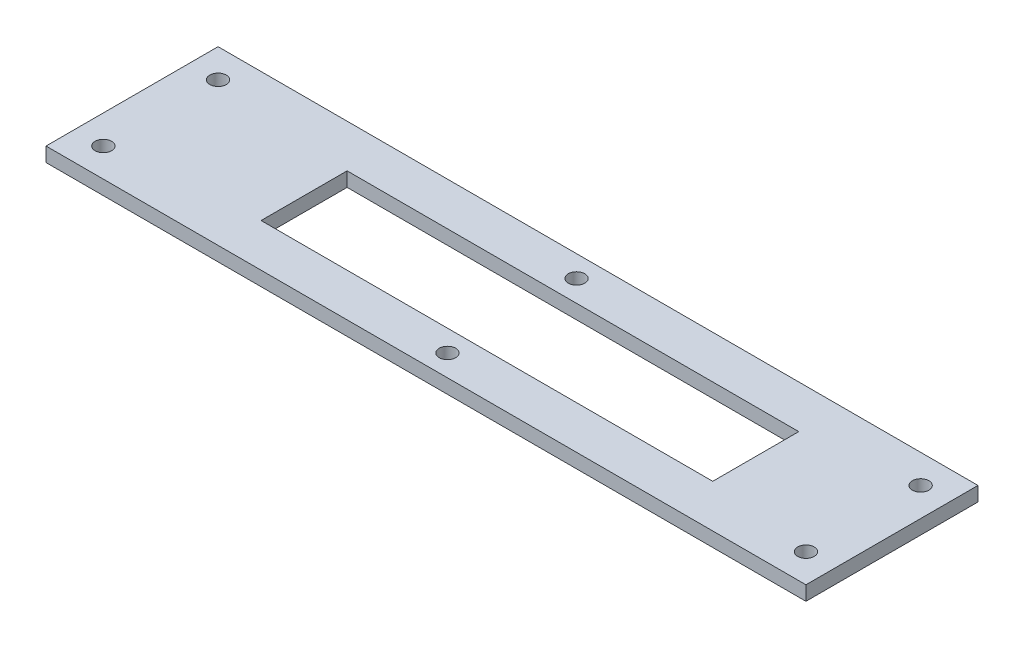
from build123d import *

# Parameters (mm, degrees)
SKETCH1_W           = 106
SKETCH1_H           = 24
SKETCH1_R           = 1.15
SKETCH1_W_2         = 63
SKETCH1_H_2         = 12
BOSS_EXTRUDE1_DEPTH = 2


with BuildPart() as part:
    # Sketch1 → Boss-Extrude1 (new body)
    with BuildSketch(Plane(origin=(0, 0, 0), x_dir=(1, 0, 0), z_dir=(0, 1, 0))):
        with Locations((-0.5, 0)):
            Rectangle(SKETCH1_W, SKETCH1_H)
        with Locations(Location((-49.5, 8, 0), (0, 0, 270))):
            Circle(SKETCH1_R, mode=Mode.SUBTRACT)
        with Locations(Location((-49.5, -8, 0), (0, 0, 270))):
            Circle(SKETCH1_R, mode=Mode.SUBTRACT)
        with Locations(Location((48.5, -8, 0), (0, 0, 270))):
            Circle(SKETCH1_R, mode=Mode.SUBTRACT)
        with Locations(Location((48.5, 8, 0), (0, 0, 270))):
            Circle(SKETCH1_R, mode=Mode.SUBTRACT)
        with Locations(Location((-0.5, -9, 0), (0, 0, 270))):
            Circle(SKETCH1_R, mode=Mode.SUBTRACT)
        with Locations(Location((-0.5, 9, 0), (0, 0, 270))):
            Circle(SKETCH1_R, mode=Mode.SUBTRACT)
        with Locations((2, 0)):
            Rectangle(SKETCH1_W_2, SKETCH1_H_2, mode=Mode.SUBTRACT)
    extrude(amount=BOSS_EXTRUDE1_DEPTH)


solid = part.part
